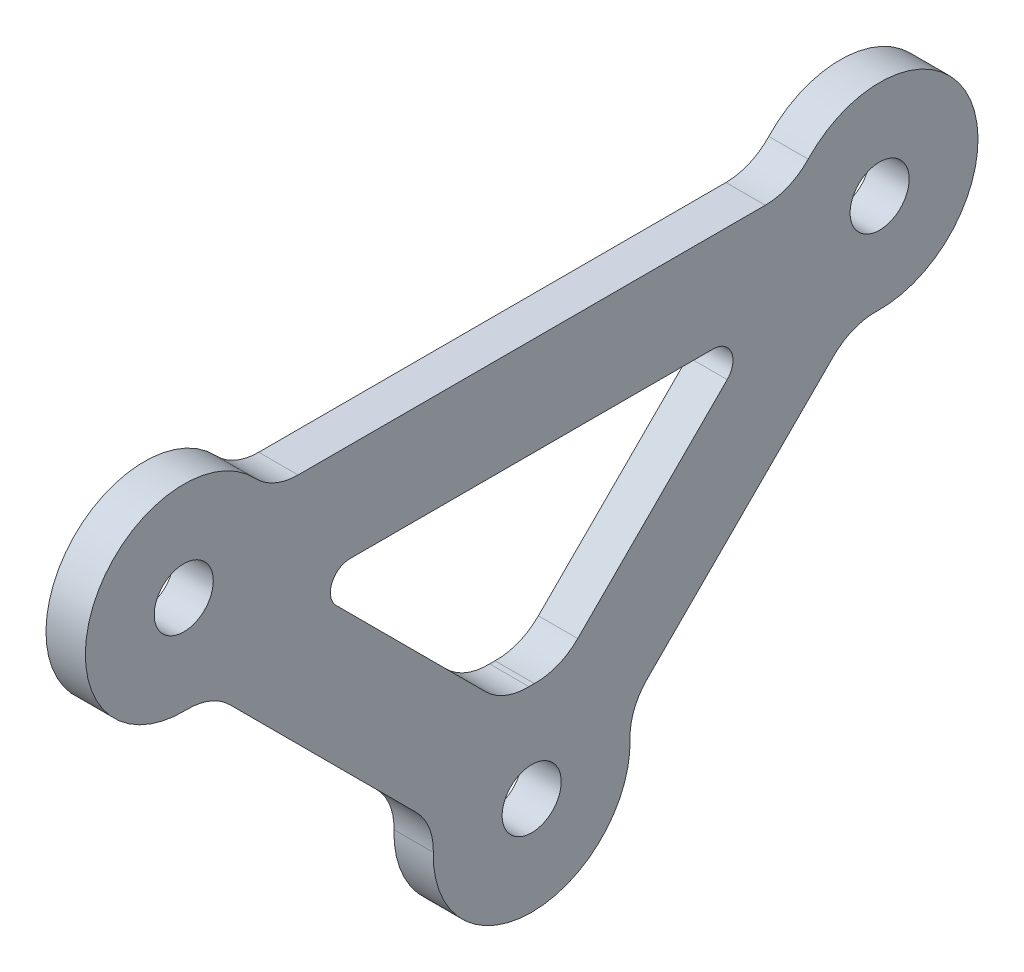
ISO-10303-21;
HEADER;
FILE_DESCRIPTION(('STEP AP214'),'2;1');
FILE_NAME('part.step','',(''),(''),'','','');
FILE_SCHEMA(('AUTOMOTIVE_DESIGN { 1 0 10303 214 1 1 1 1 }'));
ENDSEC;
DATA;
#1=APPLICATION_CONTEXT('core data for automotive mechanical design processes');
#2=APPLICATION_PROTOCOL_DEFINITION('international standard','automotive_design',2000,#1);
#3=PRODUCT_CONTEXT('',#1,'mechanical');
#4=PRODUCT('Part','Part','',(#3));
#5=PRODUCT_RELATED_PRODUCT_CATEGORY('part','',(#4));
#6=PRODUCT_DEFINITION_FORMATION('','',#4);
#7=PRODUCT_DEFINITION_CONTEXT('part definition',#1,'design');
#8=PRODUCT_DEFINITION('design','',#6,#7);
#9=PRODUCT_DEFINITION_SHAPE('','',#8);
#10=(LENGTH_UNIT() NAMED_UNIT(*) SI_UNIT(.MILLI.,.METRE.));
#11=(NAMED_UNIT(*) PLANE_ANGLE_UNIT() SI_UNIT($,.RADIAN.));
#12=(NAMED_UNIT(*) SI_UNIT($,.STERADIAN.) SOLID_ANGLE_UNIT());
#13=UNCERTAINTY_MEASURE_WITH_UNIT(LENGTH_MEASURE(1.E-05),#10,'distance_accuracy_value','');
#14=(GEOMETRIC_REPRESENTATION_CONTEXT(3) GLOBAL_UNCERTAINTY_ASSIGNED_CONTEXT((#13)) GLOBAL_UNIT_ASSIGNED_CONTEXT((#10,
#11,#12)) REPRESENTATION_CONTEXT('',''));
#15=CARTESIAN_POINT('',(0.,0.,0.));
#16=DIRECTION('',(0.,0.,1.));
#17=DIRECTION('',(1.,0.,0.));
#18=AXIS2_PLACEMENT_3D('',#15,#16,#17);
#19=CARTESIAN_POINT('',(2.,0.,0.));
#20=DIRECTION('',(1.,0.,0.));
#21=DIRECTION('',(0.,0.,-1.));
#22=AXIS2_PLACEMENT_3D('',#19,#20,#21);
#23=PLANE('',#22);
#24=DIRECTION('',(0.,0.707106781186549,-0.707106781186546));
#25=VECTOR('',#24,1.);
#26=CARTESIAN_POINT('',(2.,3.53553390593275,0.));
#27=LINE('',#26,#25);
#28=CARTESIAN_POINT('',(2.,5.87568613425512,-2.34015222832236));
#29=VERTEX_POINT('',#28);
#30=CARTESIAN_POINT('',(2.,13.4705627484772,-9.9350288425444));
#31=VERTEX_POINT('',#30);
#32=EDGE_CURVE('E343',#29,#31,#27,.T.);
#33=ORIENTED_EDGE('',*,*,#32,.F.);
#34=CARTESIAN_POINT('',(2.,7.99700647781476,-0.218831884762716));
#35=DIRECTION('',(1.,0.,0.));
#36=DIRECTION('',(0.,0.,-1.));
#37=AXIS2_PLACEMENT_3D('',#34,#35,#36);
#38=CIRCLE('',#37,3.);
#39=CARTESIAN_POINT('',(2.,4.99812904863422,-0.136769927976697));
#40=VERTEX_POINT('',#39);
#41=EDGE_CURVE('E270',#29,#40,#38,.F.);
#42=ORIENTED_EDGE('',*,*,#41,.T.);
#43=CARTESIAN_POINT('',(2.,0.,0.));
#44=DIRECTION('',(1.,0.,0.));
#45=DIRECTION('',(0.,0.,-1.));
#46=AXIS2_PLACEMENT_3D('',#43,#44,#45);
#47=CIRCLE('',#46,5.);
#48=CARTESIAN_POINT('',(2.,4.99812904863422,0.136769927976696));
#49=VERTEX_POINT('',#48);
#50=EDGE_CURVE('E767',#40,#49,#47,.T.);
#51=ORIENTED_EDGE('',*,*,#50,.T.);
#52=CARTESIAN_POINT('',(2.,7.99700647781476,0.218831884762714));
#53=DIRECTION('',(1.,0.,0.));
#54=DIRECTION('',(0.,0.,-1.));
#55=AXIS2_PLACEMENT_3D('',#52,#53,#54);
#56=CIRCLE('',#55,3.);
#57=CARTESIAN_POINT('',(2.,5.87568613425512,2.34015222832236));
#58=VERTEX_POINT('',#57);
#59=EDGE_CURVE('E194',#49,#58,#56,.F.);
#60=ORIENTED_EDGE('',*,*,#59,.T.);
#61=DIRECTION('',(0.,-0.707106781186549,-0.707106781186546));
#62=VECTOR('',#61,1.);
#63=CARTESIAN_POINT('',(2.,15.1776695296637,11.6421356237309));
#64=LINE('',#63,#62);
#65=CARTESIAN_POINT('',(2.,13.4705627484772,9.93502884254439));
#66=VERTEX_POINT('',#65);
#67=EDGE_CURVE('E338',#66,#58,#64,.T.);
#68=ORIENTED_EDGE('',*,*,#67,.F.);
#69=CARTESIAN_POINT('',(2.,14.1776695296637,9.22792206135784));
#70=DIRECTION('',(1.,0.,0.));
#71=DIRECTION('',(0.,0.,-1.));
#72=AXIS2_PLACEMENT_3D('',#69,#70,#71);
#73=CIRCLE('',#72,1.);
#74=CARTESIAN_POINT('',(2.,15.1776695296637,9.22792206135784));
#75=VERTEX_POINT('',#74);
#76=EDGE_CURVE('E325',#66,#75,#73,.F.);
#77=ORIENTED_EDGE('',*,*,#76,.T.);
#78=DIRECTION('',(0.,0.,1.));
#79=VECTOR('',#78,1.);
#80=CARTESIAN_POINT('',(2.,15.1776695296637,-11.6421356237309));
#81=LINE('',#80,#79);
#82=CARTESIAN_POINT('',(2.,15.1776695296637,-9.22792206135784));
#83=VERTEX_POINT('',#82);
#84=EDGE_CURVE('E346',#83,#75,#81,.T.);
#85=ORIENTED_EDGE('',*,*,#84,.F.);
#86=CARTESIAN_POINT('',(2.,14.1776695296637,-9.22792206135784));
#87=DIRECTION('',(1.,0.,0.));
#88=DIRECTION('',(0.,0.,-1.));
#89=AXIS2_PLACEMENT_3D('',#86,#87,#88);
#90=CIRCLE('',#89,1.);
#91=EDGE_CURVE('E11',#83,#31,#90,.F.);
#92=ORIENTED_EDGE('',*,*,#91,.T.);
#93=EDGE_LOOP('',(#33,#42,#51,#60,#68,#77,#85,#92));
#94=FACE_BOUND('',#93,.T.);
#95=DIRECTION('',(0.,-0.707106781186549,-0.707106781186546));
#96=VECTOR('',#95,1.);
#97=CARTESIAN_POINT('',(2.,20.1776695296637,23.7132034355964));
#98=LINE('',#97,#96);
#99=CARTESIAN_POINT('',(2.,11.8019833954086,15.3375173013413));
#100=VERTEX_POINT('',#99);
#101=CARTESIAN_POINT('',(2.,2.34015222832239,5.87568613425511));
#102=VERTEX_POINT('',#101);
#103=EDGE_CURVE('E368',#100,#102,#98,.T.);
#104=ORIENTED_EDGE('',*,*,#103,.T.);
#105=CARTESIAN_POINT('',(2.,0.218831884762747,7.99700647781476));
#106=DIRECTION('',(1.,0.,0.));
#107=DIRECTION('',(0.,0.,-1.));
#108=AXIS2_PLACEMENT_3D('',#105,#106,#107);
#109=CIRCLE('',#108,3.);
#110=CARTESIAN_POINT('',(2.,0.136769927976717,4.99812904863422));
#111=VERTEX_POINT('',#110);
#112=EDGE_CURVE('E273',#102,#111,#109,.F.);
#113=ORIENTED_EDGE('',*,*,#112,.T.);
#114=CARTESIAN_POINT('',(2.,0.136769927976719,-4.99812904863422));
#115=VERTEX_POINT('',#114);
#116=EDGE_CURVE('E206',#111,#115,#47,.T.);
#117=ORIENTED_EDGE('',*,*,#116,.T.);
#118=CARTESIAN_POINT('',(2.,0.21883188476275,-7.99700647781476));
#119=DIRECTION('',(1.,0.,0.));
#120=DIRECTION('',(0.,0.,-1.));
#121=AXIS2_PLACEMENT_3D('',#118,#119,#120);
#122=CIRCLE('',#121,3.);
#123=CARTESIAN_POINT('',(2.,2.34015222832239,-5.87568613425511));
#124=VERTEX_POINT('',#123);
#125=EDGE_CURVE('E282',#115,#124,#122,.F.);
#126=ORIENTED_EDGE('',*,*,#125,.T.);
#127=DIRECTION('',(0.,0.707106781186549,-0.707106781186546));
#128=VECTOR('',#127,1.);
#129=CARTESIAN_POINT('',(2.,-3.53553390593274,0.));
#130=LINE('',#129,#128);
#131=CARTESIAN_POINT('',(2.,11.8019833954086,-15.3375173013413));
#132=VERTEX_POINT('',#131);
#133=EDGE_CURVE('E372',#124,#132,#130,.T.);
#134=ORIENTED_EDGE('',*,*,#133,.T.);
#135=CARTESIAN_POINT('',(2.,9.68066305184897,-17.4588376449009));
#136=DIRECTION('',(1.,0.,0.));
#137=DIRECTION('',(0.,0.,-1.));
#138=AXIS2_PLACEMENT_3D('',#135,#136,#137);
#139=CIRCLE('',#138,3.);
#140=CARTESIAN_POINT('',(2.,12.6795404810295,-17.540899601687));
#141=VERTEX_POINT('',#140);
#142=EDGE_CURVE('E285',#132,#141,#139,.F.);
#143=ORIENTED_EDGE('',*,*,#142,.T.);
#144=CARTESIAN_POINT('',(2.,17.6776695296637,-17.6776695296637));
#145=DIRECTION('',(1.,0.,0.));
#146=DIRECTION('',(0.,0.,-1.));
#147=AXIS2_PLACEMENT_3D('',#144,#145,#146);
#148=CIRCLE('',#147,5.);
#149=CARTESIAN_POINT('',(2.,21.1151695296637,-14.0467476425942));
#150=VERTEX_POINT('',#149);
#151=EDGE_CURVE('E411',#141,#150,#148,.T.);
#152=ORIENTED_EDGE('',*,*,#151,.T.);
#153=CARTESIAN_POINT('',(2.,23.1776695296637,-11.8681945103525));
#154=DIRECTION('',(1.,0.,0.));
#155=DIRECTION('',(0.,0.,-1.));
#156=AXIS2_PLACEMENT_3D('',#153,#154,#155);
#157=CIRCLE('',#156,3.);
#158=CARTESIAN_POINT('',(2.,20.1776695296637,-11.8681945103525));
#159=VERTEX_POINT('',#158);
#160=EDGE_CURVE('E294',#150,#159,#157,.F.);
#161=ORIENTED_EDGE('',*,*,#160,.T.);
#162=DIRECTION('',(0.,0.,1.));
#163=VECTOR('',#162,1.);
#164=CARTESIAN_POINT('',(2.,20.1776695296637,-23.7132034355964));
#165=LINE('',#164,#163);
#166=CARTESIAN_POINT('',(2.,20.1776695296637,11.8681945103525));
#167=VERTEX_POINT('',#166);
#168=EDGE_CURVE('E218',#159,#167,#165,.T.);
#169=ORIENTED_EDGE('',*,*,#168,.T.);
#170=CARTESIAN_POINT('',(2.,23.1776695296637,11.8681945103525));
#171=DIRECTION('',(1.,0.,0.));
#172=DIRECTION('',(0.,0.,-1.));
#173=AXIS2_PLACEMENT_3D('',#170,#171,#172);
#174=CIRCLE('',#173,3.);
#175=CARTESIAN_POINT('',(2.,21.1151695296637,14.0467476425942));
#176=VERTEX_POINT('',#175);
#177=EDGE_CURVE('E297',#167,#176,#174,.F.);
#178=ORIENTED_EDGE('',*,*,#177,.T.);
#179=CARTESIAN_POINT('',(2.,17.6776695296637,17.6776695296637));
#180=DIRECTION('',(1.,0.,0.));
#181=DIRECTION('',(0.,0.,-1.));
#182=AXIS2_PLACEMENT_3D('',#179,#180,#181);
#183=CIRCLE('',#182,5.);
#184=CARTESIAN_POINT('',(2.,12.6795404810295,17.540899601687));
#185=VERTEX_POINT('',#184);
#186=EDGE_CURVE('E402',#176,#185,#183,.T.);
#187=ORIENTED_EDGE('',*,*,#186,.T.);
#188=CARTESIAN_POINT('',(2.,9.68066305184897,17.4588376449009));
#189=DIRECTION('',(1.,0.,0.));
#190=DIRECTION('',(0.,0.,-1.));
#191=AXIS2_PLACEMENT_3D('',#188,#189,#190);
#192=CIRCLE('',#191,3.);
#193=EDGE_CURVE('E306',#185,#100,#192,.F.);
#194=ORIENTED_EDGE('',*,*,#193,.T.);
#195=EDGE_LOOP('',(#104,#113,#117,#126,#134,#143,#152,#161,#169,#178,#187,#194));
#196=FACE_BOUND('',#195,.T.);
#197=CARTESIAN_POINT('',(2.,17.6776695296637,17.6776695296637));
#198=DIRECTION('',(1.,0.,0.));
#199=DIRECTION('',(0.,0.,-1.));
#200=AXIS2_PLACEMENT_3D('',#197,#198,#199);
#201=CIRCLE('',#200,1.5);
#202=CARTESIAN_POINT('',(2.,17.6776695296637,16.1776695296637));
#203=VERTEX_POINT('',#202);
#204=EDGE_CURVE('E357',#203,#203,#201,.T.);
#205=ORIENTED_EDGE('',*,*,#204,.F.);
#206=EDGE_LOOP('',(#205));
#207=FACE_BOUND('',#206,.T.);
#208=CARTESIAN_POINT('',(2.,17.6776695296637,-17.6776695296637));
#209=DIRECTION('',(1.,0.,0.));
#210=DIRECTION('',(0.,0.,-1.));
#211=AXIS2_PLACEMENT_3D('',#208,#209,#210);
#212=CIRCLE('',#211,1.5);
#213=CARTESIAN_POINT('',(2.,17.6776695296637,-19.1776695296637));
#214=VERTEX_POINT('',#213);
#215=EDGE_CURVE('E360',#214,#214,#212,.T.);
#216=ORIENTED_EDGE('',*,*,#215,.F.);
#217=EDGE_LOOP('',(#216));
#218=FACE_BOUND('',#217,.T.);
#219=CARTESIAN_POINT('',(2.,0.,0.));
#220=DIRECTION('',(1.,0.,0.));
#221=DIRECTION('',(0.,0.,-1.));
#222=AXIS2_PLACEMENT_3D('',#219,#220,#221);
#223=CIRCLE('',#222,1.5);
#224=CARTESIAN_POINT('',(2.,0.,-1.5));
#225=VERTEX_POINT('',#224);
#226=EDGE_CURVE('E422',#225,#225,#223,.T.);
#227=ORIENTED_EDGE('',*,*,#226,.F.);
#228=EDGE_LOOP('',(#227));
#229=FACE_BOUND('',#228,.T.);
#230=ADVANCED_FACE('F42',(#94,#196,#207,#218,#229),#23,.T.);
#231=CARTESIAN_POINT('',(0.,0.,0.));
#232=DIRECTION('',(1.,0.,0.));
#233=DIRECTION('',(0.,0.,-1.));
#234=AXIS2_PLACEMENT_3D('',#231,#232,#233);
#235=PLANE('',#234);
#236=DIRECTION('',(0.,0.,1.));
#237=VECTOR('',#236,1.);
#238=CARTESIAN_POINT('',(0.,15.1776695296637,-11.6421356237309));
#239=LINE('',#238,#237);
#240=CARTESIAN_POINT('',(0.,15.1776695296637,-9.22792206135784));
#241=VERTEX_POINT('',#240);
#242=CARTESIAN_POINT('',(0.,15.1776695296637,9.22792206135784));
#243=VERTEX_POINT('',#242);
#244=EDGE_CURVE('E330',#241,#243,#239,.T.);
#245=ORIENTED_EDGE('',*,*,#244,.T.);
#246=CARTESIAN_POINT('',(0.,14.1776695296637,9.22792206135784));
#247=DIRECTION('',(1.,0.,0.));
#248=DIRECTION('',(0.,0.,-1.));
#249=AXIS2_PLACEMENT_3D('',#246,#247,#248);
#250=CIRCLE('',#249,1.);
#251=CARTESIAN_POINT('',(0.,13.4705627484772,9.93502884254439));
#252=VERTEX_POINT('',#251);
#253=EDGE_CURVE('E322',#243,#252,#250,.T.);
#254=ORIENTED_EDGE('',*,*,#253,.T.);
#255=DIRECTION('',(0.,-0.707106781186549,-0.707106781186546));
#256=VECTOR('',#255,1.);
#257=CARTESIAN_POINT('',(0.,15.1776695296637,11.6421356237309));
#258=LINE('',#257,#256);
#259=CARTESIAN_POINT('',(0.,5.87568613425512,2.34015222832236));
#260=VERTEX_POINT('',#259);
#261=EDGE_CURVE('E187',#252,#260,#258,.T.);
#262=ORIENTED_EDGE('',*,*,#261,.T.);
#263=CARTESIAN_POINT('',(0.,7.99700647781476,0.218831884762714));
#264=DIRECTION('',(1.,0.,0.));
#265=DIRECTION('',(0.,0.,-1.));
#266=AXIS2_PLACEMENT_3D('',#263,#264,#265);
#267=CIRCLE('',#266,3.);
#268=CARTESIAN_POINT('',(0.,4.99812904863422,0.136769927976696));
#269=VERTEX_POINT('',#268);
#270=EDGE_CURVE('E180',#260,#269,#267,.T.);
#271=ORIENTED_EDGE('',*,*,#270,.T.);
#272=CARTESIAN_POINT('',(0.,0.,0.));
#273=DIRECTION('',(1.,0.,0.));
#274=DIRECTION('',(0.,0.,-1.));
#275=AXIS2_PLACEMENT_3D('',#272,#273,#274);
#276=CIRCLE('',#275,5.);
#277=CARTESIAN_POINT('',(0.,4.99812904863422,-0.136769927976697));
#278=VERTEX_POINT('',#277);
#279=EDGE_CURVE('E185',#269,#278,#276,.F.);
#280=ORIENTED_EDGE('',*,*,#279,.T.);
#281=CARTESIAN_POINT('',(0.,7.99700647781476,-0.218831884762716));
#282=DIRECTION('',(1.,0.,0.));
#283=DIRECTION('',(0.,0.,-1.));
#284=AXIS2_PLACEMENT_3D('',#281,#282,#283);
#285=CIRCLE('',#284,3.);
#286=CARTESIAN_POINT('',(0.,5.87568613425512,-2.34015222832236));
#287=VERTEX_POINT('',#286);
#288=EDGE_CURVE('E193',#278,#287,#285,.T.);
#289=ORIENTED_EDGE('',*,*,#288,.T.);
#290=DIRECTION('',(0.,0.707106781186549,-0.707106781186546));
#291=VECTOR('',#290,1.);
#292=CARTESIAN_POINT('',(0.,3.53553390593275,0.));
#293=LINE('',#292,#291);
#294=CARTESIAN_POINT('',(0.,13.4705627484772,-9.9350288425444));
#295=VERTEX_POINT('',#294);
#296=EDGE_CURVE('E332',#287,#295,#293,.T.);
#297=ORIENTED_EDGE('',*,*,#296,.T.);
#298=CARTESIAN_POINT('',(0.,14.1776695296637,-9.22792206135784));
#299=DIRECTION('',(1.,0.,0.));
#300=DIRECTION('',(0.,0.,-1.));
#301=AXIS2_PLACEMENT_3D('',#298,#299,#300);
#302=CIRCLE('',#301,1.);
#303=EDGE_CURVE('E51',#295,#241,#302,.T.);
#304=ORIENTED_EDGE('',*,*,#303,.T.);
#305=EDGE_LOOP('',(#245,#254,#262,#271,#280,#289,#297,#304));
#306=FACE_BOUND('',#305,.T.);
#307=DIRECTION('',(0.,0.707106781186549,-0.707106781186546));
#308=VECTOR('',#307,1.);
#309=CARTESIAN_POINT('',(0.,-3.53553390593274,0.));
#310=LINE('',#309,#308);
#311=CARTESIAN_POINT('',(0.,2.34015222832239,-5.87568613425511));
#312=VERTEX_POINT('',#311);
#313=CARTESIAN_POINT('',(0.,11.8019833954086,-15.3375173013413));
#314=VERTEX_POINT('',#313);
#315=EDGE_CURVE('E383',#312,#314,#310,.T.);
#316=ORIENTED_EDGE('',*,*,#315,.F.);
#317=CARTESIAN_POINT('',(0.,0.21883188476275,-7.99700647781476));
#318=DIRECTION('',(1.,0.,0.));
#319=DIRECTION('',(0.,0.,-1.));
#320=AXIS2_PLACEMENT_3D('',#317,#318,#319);
#321=CIRCLE('',#320,3.);
#322=CARTESIAN_POINT('',(0.,0.136769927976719,-4.99812904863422));
#323=VERTEX_POINT('',#322);
#324=EDGE_CURVE('E279',#312,#323,#321,.T.);
#325=ORIENTED_EDGE('',*,*,#324,.T.);
#326=CARTESIAN_POINT('',(0.,0.136769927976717,4.99812904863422));
#327=VERTEX_POINT('',#326);
#328=EDGE_CURVE('E207',#323,#327,#276,.F.);
#329=ORIENTED_EDGE('',*,*,#328,.T.);
#330=CARTESIAN_POINT('',(0.,0.218831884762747,7.99700647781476));
#331=DIRECTION('',(1.,0.,0.));
#332=DIRECTION('',(0.,0.,-1.));
#333=AXIS2_PLACEMENT_3D('',#330,#331,#332);
#334=CIRCLE('',#333,3.);
#335=CARTESIAN_POINT('',(0.,2.34015222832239,5.87568613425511));
#336=VERTEX_POINT('',#335);
#337=EDGE_CURVE('E276',#327,#336,#334,.T.);
#338=ORIENTED_EDGE('',*,*,#337,.T.);
#339=DIRECTION('',(0.,-0.707106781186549,-0.707106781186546));
#340=VECTOR('',#339,1.);
#341=CARTESIAN_POINT('',(0.,20.1776695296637,23.7132034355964));
#342=LINE('',#341,#340);
#343=CARTESIAN_POINT('',(0.,11.8019833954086,15.3375173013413));
#344=VERTEX_POINT('',#343);
#345=EDGE_CURVE('E364',#344,#336,#342,.T.);
#346=ORIENTED_EDGE('',*,*,#345,.F.);
#347=CARTESIAN_POINT('',(0.,9.68066305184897,17.4588376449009));
#348=DIRECTION('',(1.,0.,0.));
#349=DIRECTION('',(0.,0.,-1.));
#350=AXIS2_PLACEMENT_3D('',#347,#348,#349);
#351=CIRCLE('',#350,3.);
#352=CARTESIAN_POINT('',(0.,12.6795404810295,17.540899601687));
#353=VERTEX_POINT('',#352);
#354=EDGE_CURVE('E303',#344,#353,#351,.T.);
#355=ORIENTED_EDGE('',*,*,#354,.T.);
#356=CARTESIAN_POINT('',(0.,17.6776695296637,17.6776695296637));
#357=DIRECTION('',(1.,0.,0.));
#358=DIRECTION('',(0.,0.,-1.));
#359=AXIS2_PLACEMENT_3D('',#356,#357,#358);
#360=CIRCLE('',#359,5.);
#361=CARTESIAN_POINT('',(0.,21.1151695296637,14.0467476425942));
#362=VERTEX_POINT('',#361);
#363=EDGE_CURVE('E410',#353,#362,#360,.F.);
#364=ORIENTED_EDGE('',*,*,#363,.T.);
#365=CARTESIAN_POINT('',(0.,23.1776695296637,11.8681945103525));
#366=DIRECTION('',(1.,0.,0.));
#367=DIRECTION('',(0.,0.,-1.));
#368=AXIS2_PLACEMENT_3D('',#365,#366,#367);
#369=CIRCLE('',#368,3.);
#370=CARTESIAN_POINT('',(0.,20.1776695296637,11.8681945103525));
#371=VERTEX_POINT('',#370);
#372=EDGE_CURVE('E300',#362,#371,#369,.T.);
#373=ORIENTED_EDGE('',*,*,#372,.T.);
#374=DIRECTION('',(0.,0.,1.));
#375=VECTOR('',#374,1.);
#376=CARTESIAN_POINT('',(0.,20.1776695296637,-23.7132034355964));
#377=LINE('',#376,#375);
#378=CARTESIAN_POINT('',(0.,20.1776695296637,-11.8681945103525));
#379=VERTEX_POINT('',#378);
#380=EDGE_CURVE('E373',#379,#371,#377,.T.);
#381=ORIENTED_EDGE('',*,*,#380,.F.);
#382=CARTESIAN_POINT('',(0.,23.1776695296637,-11.8681945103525));
#383=DIRECTION('',(1.,0.,0.));
#384=DIRECTION('',(0.,0.,-1.));
#385=AXIS2_PLACEMENT_3D('',#382,#383,#384);
#386=CIRCLE('',#385,3.);
#387=CARTESIAN_POINT('',(0.,21.1151695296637,-14.0467476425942));
#388=VERTEX_POINT('',#387);
#389=EDGE_CURVE('E291',#379,#388,#386,.T.);
#390=ORIENTED_EDGE('',*,*,#389,.T.);
#391=CARTESIAN_POINT('',(0.,17.6776695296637,-17.6776695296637));
#392=DIRECTION('',(1.,0.,0.));
#393=DIRECTION('',(0.,0.,-1.));
#394=AXIS2_PLACEMENT_3D('',#391,#392,#393);
#395=CIRCLE('',#394,5.);
#396=CARTESIAN_POINT('',(0.,12.6795404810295,-17.540899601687));
#397=VERTEX_POINT('',#396);
#398=EDGE_CURVE('E418',#388,#397,#395,.F.);
#399=ORIENTED_EDGE('',*,*,#398,.T.);
#400=CARTESIAN_POINT('',(0.,9.68066305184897,-17.4588376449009));
#401=DIRECTION('',(1.,0.,0.));
#402=DIRECTION('',(0.,0.,-1.));
#403=AXIS2_PLACEMENT_3D('',#400,#401,#402);
#404=CIRCLE('',#403,3.);
#405=EDGE_CURVE('E288',#397,#314,#404,.T.);
#406=ORIENTED_EDGE('',*,*,#405,.T.);
#407=EDGE_LOOP('',(#316,#325,#329,#338,#346,#355,#364,#373,#381,#390,#399,#406));
#408=FACE_BOUND('',#407,.T.);
#409=CARTESIAN_POINT('',(0.,17.6776695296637,17.6776695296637));
#410=DIRECTION('',(1.,0.,0.));
#411=DIRECTION('',(0.,0.,-1.));
#412=AXIS2_PLACEMENT_3D('',#409,#410,#411);
#413=CIRCLE('',#412,1.5);
#414=CARTESIAN_POINT('',(0.,17.6776695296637,16.1776695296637));
#415=VERTEX_POINT('',#414);
#416=EDGE_CURVE('E426',#415,#415,#413,.T.);
#417=ORIENTED_EDGE('',*,*,#416,.T.);
#418=EDGE_LOOP('',(#417));
#419=FACE_BOUND('',#418,.T.);
#420=CARTESIAN_POINT('',(0.,17.6776695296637,-17.6776695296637));
#421=DIRECTION('',(1.,0.,0.));
#422=DIRECTION('',(0.,0.,-1.));
#423=AXIS2_PLACEMENT_3D('',#420,#421,#422);
#424=CIRCLE('',#423,1.5);
#425=CARTESIAN_POINT('',(0.,17.6776695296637,-19.1776695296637));
#426=VERTEX_POINT('',#425);
#427=EDGE_CURVE('E350',#426,#426,#424,.T.);
#428=ORIENTED_EDGE('',*,*,#427,.T.);
#429=EDGE_LOOP('',(#428));
#430=FACE_BOUND('',#429,.T.);
#431=CARTESIAN_POINT('',(0.,0.,0.));
#432=DIRECTION('',(1.,0.,0.));
#433=DIRECTION('',(0.,0.,-1.));
#434=AXIS2_PLACEMENT_3D('',#431,#432,#433);
#435=CIRCLE('',#434,1.5);
#436=CARTESIAN_POINT('',(0.,0.,-1.5));
#437=VERTEX_POINT('',#436);
#438=EDGE_CURVE('E415',#437,#437,#435,.T.);
#439=ORIENTED_EDGE('',*,*,#438,.T.);
#440=EDGE_LOOP('',(#439));
#441=FACE_BOUND('',#440,.T.);
#442=ADVANCED_FACE('F183',(#306,#408,#419,#430,#441),#235,.F.);
#443=CARTESIAN_POINT('',(2.,20.1776695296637,23.7132034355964));
#444=DIRECTION('',(0.,0.707106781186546,-0.707106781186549));
#445=DIRECTION('',(0.,0.707106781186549,0.707106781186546));
#446=AXIS2_PLACEMENT_3D('',#443,#444,#445);
#447=PLANE('',#446);
#448=ORIENTED_EDGE('',*,*,#345,.T.);
#449=DIRECTION('',(1.,0.,0.));
#450=VECTOR('',#449,1.);
#451=CARTESIAN_POINT('',(2.,2.34015222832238,5.87568613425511));
#452=LINE('',#451,#450);
#453=EDGE_CURVE('E228',#336,#102,#452,.T.);
#454=ORIENTED_EDGE('',*,*,#453,.T.);
#455=ORIENTED_EDGE('',*,*,#103,.F.);
#456=DIRECTION('',(1.,0.,0.));
#457=VECTOR('',#456,1.);
#458=CARTESIAN_POINT('',(2.,11.8019833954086,15.3375173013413));
#459=LINE('',#458,#457);
#460=EDGE_CURVE('E224',#100,#344,#459,.F.);
#461=ORIENTED_EDGE('',*,*,#460,.T.);
#462=EDGE_LOOP('',(#448,#454,#455,#461));
#463=FACE_BOUND('',#462,.T.);
#464=ADVANCED_FACE('F455',(#463),#447,.F.);
#465=CARTESIAN_POINT('',(2.,-3.53553390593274,0.));
#466=DIRECTION('',(0.,0.707106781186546,0.707106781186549));
#467=DIRECTION('',(0.,-0.707106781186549,0.707106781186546));
#468=AXIS2_PLACEMENT_3D('',#465,#466,#467);
#469=PLANE('',#468);
#470=ORIENTED_EDGE('',*,*,#133,.F.);
#471=DIRECTION('',(1.,0.,0.));
#472=VECTOR('',#471,1.);
#473=CARTESIAN_POINT('',(2.,2.34015222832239,-5.87568613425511));
#474=LINE('',#473,#472);
#475=EDGE_CURVE('E242',#124,#312,#474,.F.);
#476=ORIENTED_EDGE('',*,*,#475,.T.);
#477=ORIENTED_EDGE('',*,*,#315,.T.);
#478=DIRECTION('',(1.,0.,0.));
#479=VECTOR('',#478,1.);
#480=CARTESIAN_POINT('',(2.,11.8019833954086,-15.3375173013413));
#481=LINE('',#480,#479);
#482=EDGE_CURVE('E238',#314,#132,#481,.T.);
#483=ORIENTED_EDGE('',*,*,#482,.T.);
#484=EDGE_LOOP('',(#470,#476,#477,#483));
#485=FACE_BOUND('',#484,.T.);
#486=ADVANCED_FACE('F463',(#485),#469,.F.);
#487=CARTESIAN_POINT('',(2.,20.1776695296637,-23.7132034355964));
#488=DIRECTION('',(0.,-1.,0.));
#489=DIRECTION('',(0.,0.,-1.));
#490=AXIS2_PLACEMENT_3D('',#487,#488,#489);
#491=PLANE('',#490);
#492=ORIENTED_EDGE('',*,*,#168,.F.);
#493=DIRECTION('',(1.,0.,0.));
#494=VECTOR('',#493,1.);
#495=CARTESIAN_POINT('',(2.,20.1776695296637,-11.8681945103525));
#496=LINE('',#495,#494);
#497=EDGE_CURVE('E256',#159,#379,#496,.F.);
#498=ORIENTED_EDGE('',*,*,#497,.T.);
#499=ORIENTED_EDGE('',*,*,#380,.T.);
#500=DIRECTION('',(1.,0.,0.));
#501=VECTOR('',#500,1.);
#502=CARTESIAN_POINT('',(2.,20.1776695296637,11.8681945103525));
#503=LINE('',#502,#501);
#504=EDGE_CURVE('E252',#371,#167,#503,.T.);
#505=ORIENTED_EDGE('',*,*,#504,.T.);
#506=EDGE_LOOP('',(#492,#498,#499,#505));
#507=FACE_BOUND('',#506,.T.);
#508=ADVANCED_FACE('F392',(#507),#491,.F.);
#509=CARTESIAN_POINT('',(2.,17.6776695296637,-17.6776695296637));
#510=DIRECTION('',(-1.,0.,0.));
#511=DIRECTION('',(0.,0.,1.));
#512=AXIS2_PLACEMENT_3D('',#509,#510,#511);
#513=CYLINDRICAL_SURFACE('',#512,1.5);
#514=ORIENTED_EDGE('',*,*,#215,.T.);
#515=EDGE_LOOP('',(#514));
#516=FACE_BOUND('',#515,.T.);
#517=ORIENTED_EDGE('',*,*,#427,.F.);
#518=EDGE_LOOP('',(#517));
#519=FACE_BOUND('',#518,.T.);
#520=ADVANCED_FACE('F458',(#516,#519),#513,.F.);
#521=CARTESIAN_POINT('',(2.,15.1776695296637,11.6421356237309));
#522=DIRECTION('',(0.,0.707106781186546,-0.707106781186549));
#523=DIRECTION('',(0.,0.707106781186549,0.707106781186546));
#524=AXIS2_PLACEMENT_3D('',#521,#522,#523);
#525=PLANE('',#524);
#526=ORIENTED_EDGE('',*,*,#261,.F.);
#527=DIRECTION('',(-1.,0.,0.));
#528=VECTOR('',#527,1.);
#529=CARTESIAN_POINT('',(2.,13.4705627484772,9.93502884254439));
#530=LINE('',#529,#528);
#531=EDGE_CURVE('E316',#252,#66,#530,.F.);
#532=ORIENTED_EDGE('',*,*,#531,.T.);
#533=ORIENTED_EDGE('',*,*,#67,.T.);
#534=DIRECTION('',(-1.,0.,0.));
#535=VECTOR('',#534,1.);
#536=CARTESIAN_POINT('',(0.,5.87568613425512,2.34015222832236));
#537=LINE('',#536,#535);
#538=EDGE_CURVE('E212',#58,#260,#537,.T.);
#539=ORIENTED_EDGE('',*,*,#538,.T.);
#540=EDGE_LOOP('',(#526,#532,#533,#539));
#541=FACE_BOUND('',#540,.T.);
#542=ADVANCED_FACE('F507',(#541),#525,.T.);
#543=CARTESIAN_POINT('',(2.,3.53553390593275,0.));
#544=DIRECTION('',(0.,0.707106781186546,0.707106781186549));
#545=DIRECTION('',(0.,-0.707106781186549,0.707106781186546));
#546=AXIS2_PLACEMENT_3D('',#543,#544,#545);
#547=PLANE('',#546);
#548=ORIENTED_EDGE('',*,*,#32,.T.);
#549=DIRECTION('',(-1.,0.,0.));
#550=VECTOR('',#549,1.);
#551=CARTESIAN_POINT('',(0.,13.4705627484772,-9.93502884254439));
#552=LINE('',#551,#550);
#553=EDGE_CURVE('E319',#31,#295,#552,.T.);
#554=ORIENTED_EDGE('',*,*,#553,.T.);
#555=ORIENTED_EDGE('',*,*,#296,.F.);
#556=DIRECTION('',(-1.,0.,0.));
#557=VECTOR('',#556,1.);
#558=CARTESIAN_POINT('',(2.,5.87568613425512,-2.34015222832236));
#559=LINE('',#558,#557);
#560=EDGE_CURVE('E216',#287,#29,#559,.F.);
#561=ORIENTED_EDGE('',*,*,#560,.T.);
#562=EDGE_LOOP('',(#548,#554,#555,#561));
#563=FACE_BOUND('',#562,.T.);
#564=ADVANCED_FACE('F341',(#563),#547,.T.);
#565=CARTESIAN_POINT('',(2.,15.1776695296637,-11.6421356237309));
#566=DIRECTION('',(0.,-1.,0.));
#567=DIRECTION('',(0.,0.,-1.));
#568=AXIS2_PLACEMENT_3D('',#565,#566,#567);
#569=PLANE('',#568);
#570=ORIENTED_EDGE('',*,*,#84,.T.);
#571=DIRECTION('',(-1.,0.,0.));
#572=VECTOR('',#571,1.);
#573=CARTESIAN_POINT('',(0.,15.1776695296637,9.22792206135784));
#574=LINE('',#573,#572);
#575=EDGE_CURVE('E312',#75,#243,#574,.T.);
#576=ORIENTED_EDGE('',*,*,#575,.T.);
#577=ORIENTED_EDGE('',*,*,#244,.F.);
#578=DIRECTION('',(-1.,0.,0.));
#579=VECTOR('',#578,1.);
#580=CARTESIAN_POINT('',(2.,15.1776695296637,-9.22792206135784));
#581=LINE('',#580,#579);
#582=EDGE_CURVE('E309',#241,#83,#581,.F.);
#583=ORIENTED_EDGE('',*,*,#582,.T.);
#584=EDGE_LOOP('',(#570,#576,#577,#583));
#585=FACE_BOUND('',#584,.T.);
#586=ADVANCED_FACE('F335',(#585),#569,.T.);
#587=CARTESIAN_POINT('',(2.,17.6776695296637,17.6776695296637));
#588=DIRECTION('',(-1.,0.,0.));
#589=DIRECTION('',(0.,0.,1.));
#590=AXIS2_PLACEMENT_3D('',#587,#588,#589);
#591=CYLINDRICAL_SURFACE('',#590,1.5);
#592=ORIENTED_EDGE('',*,*,#204,.T.);
#593=EDGE_LOOP('',(#592));
#594=FACE_BOUND('',#593,.T.);
#595=ORIENTED_EDGE('',*,*,#416,.F.);
#596=EDGE_LOOP('',(#595));
#597=FACE_BOUND('',#596,.T.);
#598=ADVANCED_FACE('F438',(#594,#597),#591,.F.);
#599=CARTESIAN_POINT('',(2.,0.,0.));
#600=DIRECTION('',(-1.,0.,0.));
#601=DIRECTION('',(0.,0.,1.));
#602=AXIS2_PLACEMENT_3D('',#599,#600,#601);
#603=CYLINDRICAL_SURFACE('',#602,1.5);
#604=ORIENTED_EDGE('',*,*,#226,.T.);
#605=EDGE_LOOP('',(#604));
#606=FACE_BOUND('',#605,.T.);
#607=ORIENTED_EDGE('',*,*,#438,.F.);
#608=EDGE_LOOP('',(#607));
#609=FACE_BOUND('',#608,.T.);
#610=ADVANCED_FACE('F440',(#606,#609),#603,.F.);
#611=CARTESIAN_POINT('',(-14.142135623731,17.6776695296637,17.6776695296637));
#612=DIRECTION('',(1.,0.,0.));
#613=DIRECTION('',(0.,0.,-1.));
#614=AXIS2_PLACEMENT_3D('',#611,#612,#613);
#615=CYLINDRICAL_SURFACE('',#614,5.);
#616=ORIENTED_EDGE('',*,*,#186,.F.);
#617=DIRECTION('',(1.,0.,0.));
#618=VECTOR('',#617,1.);
#619=CARTESIAN_POINT('',(-14.142135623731,21.1151695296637,14.0467476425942));
#620=LINE('',#619,#618);
#621=EDGE_CURVE('E263',#176,#362,#620,.F.);
#622=ORIENTED_EDGE('',*,*,#621,.T.);
#623=ORIENTED_EDGE('',*,*,#363,.F.);
#624=DIRECTION('',(1.,0.,0.));
#625=VECTOR('',#624,1.);
#626=CARTESIAN_POINT('',(-14.142135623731,12.6795404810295,17.540899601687));
#627=LINE('',#626,#625);
#628=EDGE_CURVE('E260',#353,#185,#627,.T.);
#629=ORIENTED_EDGE('',*,*,#628,.T.);
#630=EDGE_LOOP('',(#616,#622,#623,#629));
#631=FACE_BOUND('',#630,.T.);
#632=ADVANCED_FACE('F405',(#631),#615,.T.);
#633=CARTESIAN_POINT('',(-14.142135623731,17.6776695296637,-17.6776695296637));
#634=DIRECTION('',(1.,0.,0.));
#635=DIRECTION('',(0.,0.,-1.));
#636=AXIS2_PLACEMENT_3D('',#633,#634,#635);
#637=CYLINDRICAL_SURFACE('',#636,5.);
#638=ORIENTED_EDGE('',*,*,#151,.F.);
#639=DIRECTION('',(1.,0.,0.));
#640=VECTOR('',#639,1.);
#641=CARTESIAN_POINT('',(-14.142135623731,12.6795404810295,-17.540899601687));
#642=LINE('',#641,#640);
#643=EDGE_CURVE('E249',#141,#397,#642,.F.);
#644=ORIENTED_EDGE('',*,*,#643,.T.);
#645=ORIENTED_EDGE('',*,*,#398,.F.);
#646=DIRECTION('',(1.,0.,0.));
#647=VECTOR('',#646,1.);
#648=CARTESIAN_POINT('',(-14.142135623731,21.1151695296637,-14.0467476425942));
#649=LINE('',#648,#647);
#650=EDGE_CURVE('E246',#388,#150,#649,.T.);
#651=ORIENTED_EDGE('',*,*,#650,.T.);
#652=EDGE_LOOP('',(#638,#644,#645,#651));
#653=FACE_BOUND('',#652,.T.);
#654=ADVANCED_FACE('F648',(#653),#637,.T.);
#655=CARTESIAN_POINT('',(-14.142135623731,0.,0.));
#656=DIRECTION('',(1.,0.,0.));
#657=DIRECTION('',(0.,0.,-1.));
#658=AXIS2_PLACEMENT_3D('',#655,#656,#657);
#659=CYLINDRICAL_SURFACE('',#658,5.);
#660=ORIENTED_EDGE('',*,*,#116,.F.);
#661=DIRECTION('',(1.,0.,0.));
#662=VECTOR('',#661,1.);
#663=CARTESIAN_POINT('',(-14.142135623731,0.136769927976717,4.99812904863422));
#664=LINE('',#663,#662);
#665=EDGE_CURVE('E235',#111,#327,#664,.F.);
#666=ORIENTED_EDGE('',*,*,#665,.T.);
#667=ORIENTED_EDGE('',*,*,#328,.F.);
#668=DIRECTION('',(1.,0.,0.));
#669=VECTOR('',#668,1.);
#670=CARTESIAN_POINT('',(-14.142135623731,0.136769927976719,-4.99812904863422));
#671=LINE('',#670,#669);
#672=EDGE_CURVE('E232',#323,#115,#671,.T.);
#673=ORIENTED_EDGE('',*,*,#672,.T.);
#674=EDGE_LOOP('',(#660,#666,#667,#673));
#675=FACE_BOUND('',#674,.T.);
#676=ADVANCED_FACE('F639',(#675),#659,.T.);
#677=ORIENTED_EDGE('',*,*,#279,.F.);
#678=DIRECTION('',(1.,0.,0.));
#679=VECTOR('',#678,1.);
#680=CARTESIAN_POINT('',(-14.142135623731,4.99812904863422,0.136769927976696));
#681=LINE('',#680,#679);
#682=EDGE_CURVE('E201',#269,#49,#681,.T.);
#683=ORIENTED_EDGE('',*,*,#682,.T.);
#684=ORIENTED_EDGE('',*,*,#50,.F.);
#685=DIRECTION('',(1.,0.,0.));
#686=VECTOR('',#685,1.);
#687=CARTESIAN_POINT('',(-14.142135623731,4.99812904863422,-0.136769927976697));
#688=LINE('',#687,#686);
#689=EDGE_CURVE('E204',#40,#278,#688,.F.);
#690=ORIENTED_EDGE('',*,*,#689,.T.);
#691=EDGE_LOOP('',(#677,#683,#684,#690));
#692=FACE_BOUND('',#691,.T.);
#693=ADVANCED_FACE('F199',(#692),#659,.T.);
#694=CARTESIAN_POINT('',(-14.142135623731,7.99700647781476,0.218831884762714));
#695=DIRECTION('',(1.,0.,0.));
#696=DIRECTION('',(0.,0.,-1.));
#697=AXIS2_PLACEMENT_3D('',#694,#695,#696);
#698=CYLINDRICAL_SURFACE('',#697,3.);
#699=ORIENTED_EDGE('',*,*,#270,.F.);
#700=ORIENTED_EDGE('',*,*,#538,.F.);
#701=ORIENTED_EDGE('',*,*,#59,.F.);
#702=ORIENTED_EDGE('',*,*,#682,.F.);
#703=EDGE_LOOP('',(#699,#700,#701,#702));
#704=FACE_BOUND('',#703,.T.);
#705=ADVANCED_FACE('F209',(#704),#698,.F.);
#706=CARTESIAN_POINT('',(-14.142135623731,7.99700647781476,-0.218831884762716));
#707=DIRECTION('',(1.,0.,0.));
#708=DIRECTION('',(0.,0.,-1.));
#709=AXIS2_PLACEMENT_3D('',#706,#707,#708);
#710=CYLINDRICAL_SURFACE('',#709,3.);
#711=ORIENTED_EDGE('',*,*,#41,.F.);
#712=ORIENTED_EDGE('',*,*,#560,.F.);
#713=ORIENTED_EDGE('',*,*,#288,.F.);
#714=ORIENTED_EDGE('',*,*,#689,.F.);
#715=EDGE_LOOP('',(#711,#712,#713,#714));
#716=FACE_BOUND('',#715,.T.);
#717=ADVANCED_FACE('F472',(#716),#710,.F.);
#718=CARTESIAN_POINT('',(-14.142135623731,0.218831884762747,7.99700647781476));
#719=DIRECTION('',(1.,0.,0.));
#720=DIRECTION('',(0.,0.,-1.));
#721=AXIS2_PLACEMENT_3D('',#718,#719,#720);
#722=CYLINDRICAL_SURFACE('',#721,3.);
#723=ORIENTED_EDGE('',*,*,#337,.F.);
#724=ORIENTED_EDGE('',*,*,#665,.F.);
#725=ORIENTED_EDGE('',*,*,#112,.F.);
#726=ORIENTED_EDGE('',*,*,#453,.F.);
#727=EDGE_LOOP('',(#723,#724,#725,#726));
#728=FACE_BOUND('',#727,.T.);
#729=ADVANCED_FACE('F475',(#728),#722,.F.);
#730=CARTESIAN_POINT('',(-14.142135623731,0.21883188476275,-7.99700647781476));
#731=DIRECTION('',(1.,0.,0.));
#732=DIRECTION('',(0.,0.,-1.));
#733=AXIS2_PLACEMENT_3D('',#730,#731,#732);
#734=CYLINDRICAL_SURFACE('',#733,3.);
#735=ORIENTED_EDGE('',*,*,#125,.F.);
#736=ORIENTED_EDGE('',*,*,#672,.F.);
#737=ORIENTED_EDGE('',*,*,#324,.F.);
#738=ORIENTED_EDGE('',*,*,#475,.F.);
#739=EDGE_LOOP('',(#735,#736,#737,#738));
#740=FACE_BOUND('',#739,.T.);
#741=ADVANCED_FACE('F479',(#740),#734,.F.);
#742=CARTESIAN_POINT('',(-14.142135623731,9.68066305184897,-17.4588376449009));
#743=DIRECTION('',(1.,0.,0.));
#744=DIRECTION('',(0.,0.,-1.));
#745=AXIS2_PLACEMENT_3D('',#742,#743,#744);
#746=CYLINDRICAL_SURFACE('',#745,3.);
#747=ORIENTED_EDGE('',*,*,#405,.F.);
#748=ORIENTED_EDGE('',*,*,#643,.F.);
#749=ORIENTED_EDGE('',*,*,#142,.F.);
#750=ORIENTED_EDGE('',*,*,#482,.F.);
#751=EDGE_LOOP('',(#747,#748,#749,#750));
#752=FACE_BOUND('',#751,.T.);
#753=ADVANCED_FACE('F483',(#752),#746,.F.);
#754=CARTESIAN_POINT('',(-14.142135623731,23.1776695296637,-11.8681945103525));
#755=DIRECTION('',(1.,0.,0.));
#756=DIRECTION('',(0.,0.,-1.));
#757=AXIS2_PLACEMENT_3D('',#754,#755,#756);
#758=CYLINDRICAL_SURFACE('',#757,3.);
#759=ORIENTED_EDGE('',*,*,#160,.F.);
#760=ORIENTED_EDGE('',*,*,#650,.F.);
#761=ORIENTED_EDGE('',*,*,#389,.F.);
#762=ORIENTED_EDGE('',*,*,#497,.F.);
#763=EDGE_LOOP('',(#759,#760,#761,#762));
#764=FACE_BOUND('',#763,.T.);
#765=ADVANCED_FACE('F487',(#764),#758,.F.);
#766=CARTESIAN_POINT('',(-14.142135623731,23.1776695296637,11.8681945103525));
#767=DIRECTION('',(1.,0.,0.));
#768=DIRECTION('',(0.,0.,-1.));
#769=AXIS2_PLACEMENT_3D('',#766,#767,#768);
#770=CYLINDRICAL_SURFACE('',#769,3.);
#771=ORIENTED_EDGE('',*,*,#372,.F.);
#772=ORIENTED_EDGE('',*,*,#621,.F.);
#773=ORIENTED_EDGE('',*,*,#177,.F.);
#774=ORIENTED_EDGE('',*,*,#504,.F.);
#775=EDGE_LOOP('',(#771,#772,#773,#774));
#776=FACE_BOUND('',#775,.T.);
#777=ADVANCED_FACE('F396',(#776),#770,.F.);
#778=CARTESIAN_POINT('',(-14.142135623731,9.68066305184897,17.4588376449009));
#779=DIRECTION('',(1.,0.,0.));
#780=DIRECTION('',(0.,0.,-1.));
#781=AXIS2_PLACEMENT_3D('',#778,#779,#780);
#782=CYLINDRICAL_SURFACE('',#781,3.);
#783=ORIENTED_EDGE('',*,*,#193,.F.);
#784=ORIENTED_EDGE('',*,*,#628,.F.);
#785=ORIENTED_EDGE('',*,*,#354,.F.);
#786=ORIENTED_EDGE('',*,*,#460,.F.);
#787=EDGE_LOOP('',(#783,#784,#785,#786));
#788=FACE_BOUND('',#787,.T.);
#789=ADVANCED_FACE('F494',(#788),#782,.F.);
#790=CARTESIAN_POINT('',(2.,14.1776695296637,9.22792206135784));
#791=DIRECTION('',(1.,0.,0.));
#792=DIRECTION('',(0.,0.,-1.));
#793=AXIS2_PLACEMENT_3D('',#790,#791,#792);
#794=CYLINDRICAL_SURFACE('',#793,1.);
#795=ORIENTED_EDGE('',*,*,#76,.F.);
#796=ORIENTED_EDGE('',*,*,#531,.F.);
#797=ORIENTED_EDGE('',*,*,#253,.F.);
#798=ORIENTED_EDGE('',*,*,#575,.F.);
#799=EDGE_LOOP('',(#795,#796,#797,#798));
#800=FACE_BOUND('',#799,.T.);
#801=ADVANCED_FACE('F496',(#800),#794,.F.);
#802=CARTESIAN_POINT('',(2.,14.1776695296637,-9.22792206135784));
#803=DIRECTION('',(1.,0.,0.));
#804=DIRECTION('',(0.,0.,-1.));
#805=AXIS2_PLACEMENT_3D('',#802,#803,#804);
#806=CYLINDRICAL_SURFACE('',#805,1.);
#807=ORIENTED_EDGE('',*,*,#91,.F.);
#808=ORIENTED_EDGE('',*,*,#582,.F.);
#809=ORIENTED_EDGE('',*,*,#303,.F.);
#810=ORIENTED_EDGE('',*,*,#553,.F.);
#811=EDGE_LOOP('',(#807,#808,#809,#810));
#812=FACE_BOUND('',#811,.T.);
#813=ADVANCED_FACE('F44',(#812),#806,.F.);
#814=CLOSED_SHELL('',(#230,#442,#464,#486,#508,#520,#542,#564,#586,#598,#610,#632,#654,#676,
#693,#705,#717,#729,#741,#753,#765,#777,#789,#801,#813));
#815=MANIFOLD_SOLID_BREP('B2',#814);
#816=ADVANCED_BREP_SHAPE_REPRESENTATION('',(#18,#815),#14);
#817=SHAPE_DEFINITION_REPRESENTATION(#9,#816);
ENDSEC;
END-ISO-10303-21;
